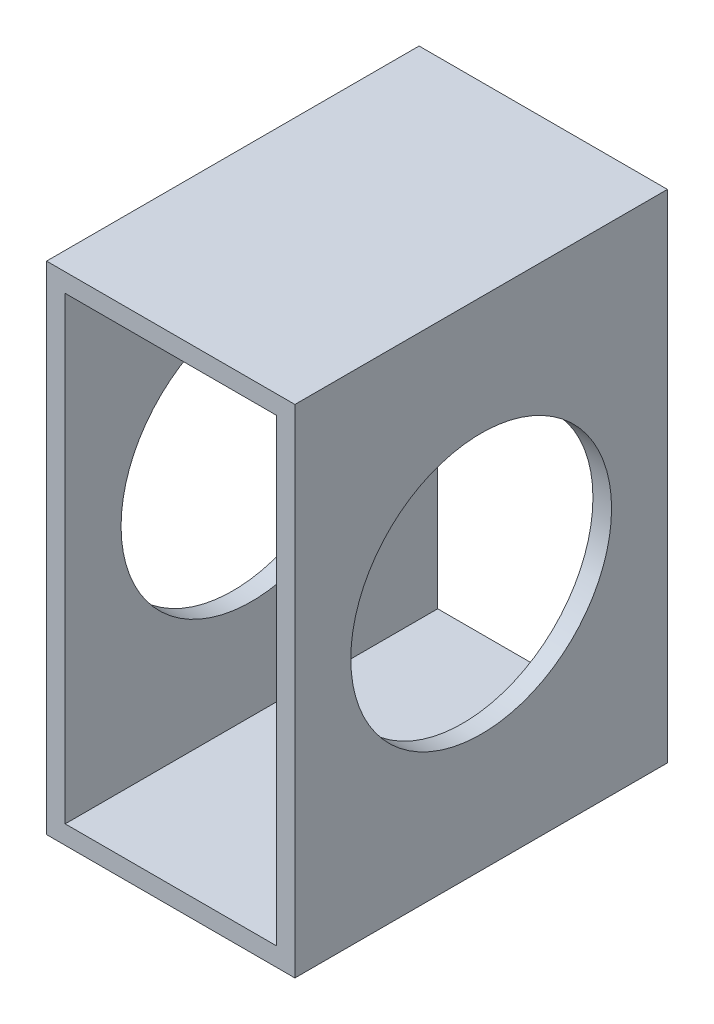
ISO-10303-21;
HEADER;
FILE_DESCRIPTION(('STEP AP214'),'2;1');
FILE_NAME('part.step','',(''),(''),'','','');
FILE_SCHEMA(('AUTOMOTIVE_DESIGN { 1 0 10303 214 1 1 1 1 }'));
ENDSEC;
DATA;
#1=APPLICATION_CONTEXT('core data for automotive mechanical design processes');
#2=APPLICATION_PROTOCOL_DEFINITION('international standard','automotive_design',2000,#1);
#3=PRODUCT_CONTEXT('',#1,'mechanical');
#4=PRODUCT('Part','Part','',(#3));
#5=PRODUCT_RELATED_PRODUCT_CATEGORY('part','',(#4));
#6=PRODUCT_DEFINITION_FORMATION('','',#4);
#7=PRODUCT_DEFINITION_CONTEXT('part definition',#1,'design');
#8=PRODUCT_DEFINITION('design','',#6,#7);
#9=PRODUCT_DEFINITION_SHAPE('','',#8);
#10=(LENGTH_UNIT() NAMED_UNIT(*) SI_UNIT(.MILLI.,.METRE.));
#11=(NAMED_UNIT(*) PLANE_ANGLE_UNIT() SI_UNIT($,.RADIAN.));
#12=(NAMED_UNIT(*) SI_UNIT($,.STERADIAN.) SOLID_ANGLE_UNIT());
#13=UNCERTAINTY_MEASURE_WITH_UNIT(LENGTH_MEASURE(1.E-05),#10,'distance_accuracy_value','');
#14=(GEOMETRIC_REPRESENTATION_CONTEXT(3) GLOBAL_UNCERTAINTY_ASSIGNED_CONTEXT((#13)) GLOBAL_UNIT_ASSIGNED_CONTEXT((#10,
#11,#12)) REPRESENTATION_CONTEXT('',''));
#15=CARTESIAN_POINT('',(0.,0.,0.));
#16=DIRECTION('',(0.,0.,1.));
#17=DIRECTION('',(1.,0.,0.));
#18=AXIS2_PLACEMENT_3D('',#15,#16,#17);
#19=CARTESIAN_POINT('',(0.,0.,30.));
#20=DIRECTION('',(0.,0.,1.));
#21=DIRECTION('',(1.,0.,0.));
#22=AXIS2_PLACEMENT_3D('',#19,#20,#21);
#23=PLANE('',#22);
#24=DIRECTION('',(0.,-1.,0.));
#25=VECTOR('',#24,1.);
#26=CARTESIAN_POINT('',(-20.,-40.,30.));
#27=LINE('',#26,#25);
#28=CARTESIAN_POINT('',(-20.,40.,30.));
#29=VERTEX_POINT('',#28);
#30=CARTESIAN_POINT('',(-20.,-40.,30.));
#31=VERTEX_POINT('',#30);
#32=EDGE_CURVE('E156',#29,#31,#27,.T.);
#33=ORIENTED_EDGE('',*,*,#32,.T.);
#34=DIRECTION('',(1.,0.,0.));
#35=VECTOR('',#34,1.);
#36=CARTESIAN_POINT('',(20.,-40.,30.));
#37=LINE('',#36,#35);
#38=CARTESIAN_POINT('',(20.,-40.,30.));
#39=VERTEX_POINT('',#38);
#40=EDGE_CURVE('E160',#31,#39,#37,.T.);
#41=ORIENTED_EDGE('',*,*,#40,.T.);
#42=DIRECTION('',(0.,1.,0.));
#43=VECTOR('',#42,1.);
#44=CARTESIAN_POINT('',(20.,-40.,30.));
#45=LINE('',#44,#43);
#46=CARTESIAN_POINT('',(20.,40.,30.));
#47=VERTEX_POINT('',#46);
#48=EDGE_CURVE('E164',#39,#47,#45,.T.);
#49=ORIENTED_EDGE('',*,*,#48,.T.);
#50=DIRECTION('',(-1.,0.,0.));
#51=VECTOR('',#50,1.);
#52=CARTESIAN_POINT('',(20.,40.,30.));
#53=LINE('',#52,#51);
#54=EDGE_CURVE('E167',#47,#29,#53,.T.);
#55=ORIENTED_EDGE('',*,*,#54,.T.);
#56=EDGE_LOOP('',(#33,#41,#49,#55));
#57=FACE_BOUND('',#56,.T.);
#58=DIRECTION('',(1.,0.,0.));
#59=VECTOR('',#58,1.);
#60=CARTESIAN_POINT('',(17.,-37.,30.));
#61=LINE('',#60,#59);
#62=CARTESIAN_POINT('',(-17.,-37.,30.));
#63=VERTEX_POINT('',#62);
#64=CARTESIAN_POINT('',(17.,-37.,30.));
#65=VERTEX_POINT('',#64);
#66=EDGE_CURVE('E115',#63,#65,#61,.T.);
#67=ORIENTED_EDGE('',*,*,#66,.F.);
#68=DIRECTION('',(0.,-1.,0.));
#69=VECTOR('',#68,1.);
#70=CARTESIAN_POINT('',(-17.,-37.,30.));
#71=LINE('',#70,#69);
#72=CARTESIAN_POINT('',(-17.,37.,30.));
#73=VERTEX_POINT('',#72);
#74=EDGE_CURVE('E106',#73,#63,#71,.T.);
#75=ORIENTED_EDGE('',*,*,#74,.F.);
#76=DIRECTION('',(-1.,0.,0.));
#77=VECTOR('',#76,1.);
#78=CARTESIAN_POINT('',(17.,37.,30.));
#79=LINE('',#78,#77);
#80=CARTESIAN_POINT('',(17.,37.,30.));
#81=VERTEX_POINT('',#80);
#82=EDGE_CURVE('E132',#81,#73,#79,.T.);
#83=ORIENTED_EDGE('',*,*,#82,.F.);
#84=DIRECTION('',(0.,1.,0.));
#85=VECTOR('',#84,1.);
#86=CARTESIAN_POINT('',(17.,-37.,30.));
#87=LINE('',#86,#85);
#88=EDGE_CURVE('E128',#65,#81,#87,.T.);
#89=ORIENTED_EDGE('',*,*,#88,.F.);
#90=EDGE_LOOP('',(#67,#75,#83,#89));
#91=FACE_BOUND('',#90,.T.);
#92=ADVANCED_FACE('F39',(#57,#91),#23,.T.);
#93=CARTESIAN_POINT('',(0.,0.,-30.));
#94=DIRECTION('',(0.,0.,1.));
#95=DIRECTION('',(1.,0.,0.));
#96=AXIS2_PLACEMENT_3D('',#93,#94,#95);
#97=PLANE('',#96);
#98=DIRECTION('',(0.,-1.,0.));
#99=VECTOR('',#98,1.);
#100=CARTESIAN_POINT('',(-20.,-40.,-30.));
#101=LINE('',#100,#99);
#102=CARTESIAN_POINT('',(-20.,40.,-30.));
#103=VERTEX_POINT('',#102);
#104=CARTESIAN_POINT('',(-20.,-40.,-30.));
#105=VERTEX_POINT('',#104);
#106=EDGE_CURVE('E124',#103,#105,#101,.T.);
#107=ORIENTED_EDGE('',*,*,#106,.F.);
#108=DIRECTION('',(-1.,0.,0.));
#109=VECTOR('',#108,1.);
#110=CARTESIAN_POINT('',(20.,40.,-30.));
#111=LINE('',#110,#109);
#112=CARTESIAN_POINT('',(20.,40.,-30.));
#113=VERTEX_POINT('',#112);
#114=EDGE_CURVE('E161',#113,#103,#111,.T.);
#115=ORIENTED_EDGE('',*,*,#114,.F.);
#116=DIRECTION('',(0.,1.,0.));
#117=VECTOR('',#116,1.);
#118=CARTESIAN_POINT('',(20.,-40.,-30.));
#119=LINE('',#118,#117);
#120=CARTESIAN_POINT('',(20.,-40.,-30.));
#121=VERTEX_POINT('',#120);
#122=EDGE_CURVE('E177',#121,#113,#119,.T.);
#123=ORIENTED_EDGE('',*,*,#122,.F.);
#124=DIRECTION('',(1.,0.,0.));
#125=VECTOR('',#124,1.);
#126=CARTESIAN_POINT('',(20.,-40.,-30.));
#127=LINE('',#126,#125);
#128=EDGE_CURVE('E174',#105,#121,#127,.T.);
#129=ORIENTED_EDGE('',*,*,#128,.F.);
#130=EDGE_LOOP('',(#107,#115,#123,#129));
#131=FACE_BOUND('',#130,.T.);
#132=DIRECTION('',(0.,-1.,0.));
#133=VECTOR('',#132,1.);
#134=CARTESIAN_POINT('',(-17.,-37.,-30.));
#135=LINE('',#134,#133);
#136=CARTESIAN_POINT('',(-17.,37.,-30.));
#137=VERTEX_POINT('',#136);
#138=CARTESIAN_POINT('',(-17.,-37.,-30.));
#139=VERTEX_POINT('',#138);
#140=EDGE_CURVE('E64',#137,#139,#135,.T.);
#141=ORIENTED_EDGE('',*,*,#140,.T.);
#142=DIRECTION('',(1.,0.,0.));
#143=VECTOR('',#142,1.);
#144=CARTESIAN_POINT('',(17.,-37.,-30.));
#145=LINE('',#144,#143);
#146=CARTESIAN_POINT('',(17.,-37.,-30.));
#147=VERTEX_POINT('',#146);
#148=EDGE_CURVE('E122',#139,#147,#145,.T.);
#149=ORIENTED_EDGE('',*,*,#148,.T.);
#150=DIRECTION('',(0.,1.,0.));
#151=VECTOR('',#150,1.);
#152=CARTESIAN_POINT('',(17.,-37.,-30.));
#153=LINE('',#152,#151);
#154=CARTESIAN_POINT('',(17.,37.,-30.));
#155=VERTEX_POINT('',#154);
#156=EDGE_CURVE('E143',#147,#155,#153,.T.);
#157=ORIENTED_EDGE('',*,*,#156,.T.);
#158=DIRECTION('',(-1.,0.,0.));
#159=VECTOR('',#158,1.);
#160=CARTESIAN_POINT('',(17.,37.,-30.));
#161=LINE('',#160,#159);
#162=EDGE_CURVE('E116',#155,#137,#161,.T.);
#163=ORIENTED_EDGE('',*,*,#162,.T.);
#164=EDGE_LOOP('',(#141,#149,#157,#163));
#165=FACE_BOUND('',#164,.T.);
#166=ADVANCED_FACE('F201',(#131,#165),#97,.F.);
#167=CARTESIAN_POINT('',(-20.,-40.,30.));
#168=DIRECTION('',(1.,0.,0.));
#169=DIRECTION('',(0.,0.,-1.));
#170=AXIS2_PLACEMENT_3D('',#167,#168,#169);
#171=PLANE('',#170);
#172=CARTESIAN_POINT('',(-20.,0.,0.));
#173=DIRECTION('',(1.,0.,0.));
#174=DIRECTION('',(0.,0.,-1.));
#175=AXIS2_PLACEMENT_3D('',#172,#173,#174);
#176=CIRCLE('',#175,21.);
#177=CARTESIAN_POINT('',(-20.,0.,-21.));
#178=VERTEX_POINT('',#177);
#179=EDGE_CURVE('E244',#178,#178,#176,.F.);
#180=ORIENTED_EDGE('',*,*,#179,.F.);
#181=EDGE_LOOP('',(#180));
#182=FACE_BOUND('',#181,.T.);
#183=ORIENTED_EDGE('',*,*,#106,.T.);
#184=DIRECTION('',(0.,0.,-1.));
#185=VECTOR('',#184,1.);
#186=CARTESIAN_POINT('',(-20.,-40.,30.));
#187=LINE('',#186,#185);
#188=EDGE_CURVE('E11',#31,#105,#187,.T.);
#189=ORIENTED_EDGE('',*,*,#188,.F.);
#190=ORIENTED_EDGE('',*,*,#32,.F.);
#191=DIRECTION('',(0.,0.,-1.));
#192=VECTOR('',#191,1.);
#193=CARTESIAN_POINT('',(-20.,40.,30.));
#194=LINE('',#193,#192);
#195=EDGE_CURVE('E170',#29,#103,#194,.T.);
#196=ORIENTED_EDGE('',*,*,#195,.T.);
#197=EDGE_LOOP('',(#183,#189,#190,#196));
#198=FACE_BOUND('',#197,.T.);
#199=ADVANCED_FACE('F41',(#182,#198),#171,.F.);
#200=CARTESIAN_POINT('',(20.,-40.,30.));
#201=DIRECTION('',(0.,1.,0.));
#202=DIRECTION('',(-1.,0.,0.));
#203=AXIS2_PLACEMENT_3D('',#200,#201,#202);
#204=PLANE('',#203);
#205=ORIENTED_EDGE('',*,*,#128,.T.);
#206=DIRECTION('',(0.,0.,-1.));
#207=VECTOR('',#206,1.);
#208=CARTESIAN_POINT('',(20.,-40.,30.));
#209=LINE('',#208,#207);
#210=EDGE_CURVE('E49',#39,#121,#209,.T.);
#211=ORIENTED_EDGE('',*,*,#210,.F.);
#212=ORIENTED_EDGE('',*,*,#40,.F.);
#213=ORIENTED_EDGE('',*,*,#188,.T.);
#214=EDGE_LOOP('',(#205,#211,#212,#213));
#215=FACE_BOUND('',#214,.T.);
#216=ADVANCED_FACE('F211',(#215),#204,.F.);
#217=CARTESIAN_POINT('',(20.,-40.,30.));
#218=DIRECTION('',(-1.,0.,0.));
#219=DIRECTION('',(0.,0.,1.));
#220=AXIS2_PLACEMENT_3D('',#217,#218,#219);
#221=PLANE('',#220);
#222=CARTESIAN_POINT('',(20.,0.,0.));
#223=DIRECTION('',(1.,0.,0.));
#224=DIRECTION('',(0.,0.,-1.));
#225=AXIS2_PLACEMENT_3D('',#222,#223,#224);
#226=CIRCLE('',#225,21.);
#227=CARTESIAN_POINT('',(20.,0.,-21.));
#228=VERTEX_POINT('',#227);
#229=EDGE_CURVE('E249',#228,#228,#226,.T.);
#230=ORIENTED_EDGE('',*,*,#229,.F.);
#231=EDGE_LOOP('',(#230));
#232=FACE_BOUND('',#231,.T.);
#233=ORIENTED_EDGE('',*,*,#122,.T.);
#234=DIRECTION('',(0.,0.,-1.));
#235=VECTOR('',#234,1.);
#236=CARTESIAN_POINT('',(20.,40.,30.));
#237=LINE('',#236,#235);
#238=EDGE_CURVE('E185',#47,#113,#237,.T.);
#239=ORIENTED_EDGE('',*,*,#238,.F.);
#240=ORIENTED_EDGE('',*,*,#48,.F.);
#241=ORIENTED_EDGE('',*,*,#210,.T.);
#242=EDGE_LOOP('',(#233,#239,#240,#241));
#243=FACE_BOUND('',#242,.T.);
#244=ADVANCED_FACE('F195',(#232,#243),#221,.F.);
#245=CARTESIAN_POINT('',(20.,40.,30.));
#246=DIRECTION('',(0.,-1.,0.));
#247=DIRECTION('',(1.,0.,0.));
#248=AXIS2_PLACEMENT_3D('',#245,#246,#247);
#249=PLANE('',#248);
#250=ORIENTED_EDGE('',*,*,#114,.T.);
#251=ORIENTED_EDGE('',*,*,#195,.F.);
#252=ORIENTED_EDGE('',*,*,#54,.F.);
#253=ORIENTED_EDGE('',*,*,#238,.T.);
#254=EDGE_LOOP('',(#250,#251,#252,#253));
#255=FACE_BOUND('',#254,.T.);
#256=ADVANCED_FACE('F205',(#255),#249,.F.);
#257=CARTESIAN_POINT('',(-17.,-37.,30.));
#258=DIRECTION('',(1.,0.,0.));
#259=DIRECTION('',(0.,0.,-1.));
#260=AXIS2_PLACEMENT_3D('',#257,#258,#259);
#261=PLANE('',#260);
#262=CARTESIAN_POINT('',(-17.,0.,0.));
#263=DIRECTION('',(1.,0.,0.));
#264=DIRECTION('',(0.,0.,-1.));
#265=AXIS2_PLACEMENT_3D('',#262,#263,#264);
#266=CIRCLE('',#265,21.);
#267=CARTESIAN_POINT('',(-17.,0.,-21.));
#268=VERTEX_POINT('',#267);
#269=EDGE_CURVE('E140',#268,#268,#266,.T.);
#270=ORIENTED_EDGE('',*,*,#269,.F.);
#271=EDGE_LOOP('',(#270));
#272=FACE_BOUND('',#271,.T.);
#273=ORIENTED_EDGE('',*,*,#140,.F.);
#274=DIRECTION('',(0.,0.,-1.));
#275=VECTOR('',#274,1.);
#276=CARTESIAN_POINT('',(-17.,37.,30.));
#277=LINE('',#276,#275);
#278=EDGE_CURVE('E110',#73,#137,#277,.T.);
#279=ORIENTED_EDGE('',*,*,#278,.F.);
#280=ORIENTED_EDGE('',*,*,#74,.T.);
#281=DIRECTION('',(0.,0.,-1.));
#282=VECTOR('',#281,1.);
#283=CARTESIAN_POINT('',(-17.,-37.,30.));
#284=LINE('',#283,#282);
#285=EDGE_CURVE('E109',#63,#139,#284,.T.);
#286=ORIENTED_EDGE('',*,*,#285,.T.);
#287=EDGE_LOOP('',(#273,#279,#280,#286));
#288=FACE_BOUND('',#287,.T.);
#289=ADVANCED_FACE('F108',(#272,#288),#261,.T.);
#290=CARTESIAN_POINT('',(17.,-37.,30.));
#291=DIRECTION('',(0.,1.,0.));
#292=DIRECTION('',(0.,0.,1.));
#293=AXIS2_PLACEMENT_3D('',#290,#291,#292);
#294=PLANE('',#293);
#295=ORIENTED_EDGE('',*,*,#148,.F.);
#296=ORIENTED_EDGE('',*,*,#285,.F.);
#297=ORIENTED_EDGE('',*,*,#66,.T.);
#298=DIRECTION('',(0.,0.,-1.));
#299=VECTOR('',#298,1.);
#300=CARTESIAN_POINT('',(17.,-37.,30.));
#301=LINE('',#300,#299);
#302=EDGE_CURVE('E125',#65,#147,#301,.T.);
#303=ORIENTED_EDGE('',*,*,#302,.T.);
#304=EDGE_LOOP('',(#295,#296,#297,#303));
#305=FACE_BOUND('',#304,.T.);
#306=ADVANCED_FACE('F119',(#305),#294,.T.);
#307=CARTESIAN_POINT('',(17.,-37.,30.));
#308=DIRECTION('',(-1.,0.,0.));
#309=DIRECTION('',(0.,0.,1.));
#310=AXIS2_PLACEMENT_3D('',#307,#308,#309);
#311=PLANE('',#310);
#312=CARTESIAN_POINT('',(17.,0.,0.));
#313=DIRECTION('',(-1.,0.,0.));
#314=DIRECTION('',(0.,0.,1.));
#315=AXIS2_PLACEMENT_3D('',#312,#313,#314);
#316=CIRCLE('',#315,21.);
#317=CARTESIAN_POINT('',(17.,0.,-21.));
#318=VERTEX_POINT('',#317);
#319=EDGE_CURVE('E43',#318,#318,#316,.T.);
#320=ORIENTED_EDGE('',*,*,#319,.F.);
#321=EDGE_LOOP('',(#320));
#322=FACE_BOUND('',#321,.T.);
#323=ORIENTED_EDGE('',*,*,#156,.F.);
#324=ORIENTED_EDGE('',*,*,#302,.F.);
#325=ORIENTED_EDGE('',*,*,#88,.T.);
#326=DIRECTION('',(0.,0.,-1.));
#327=VECTOR('',#326,1.);
#328=CARTESIAN_POINT('',(17.,37.,30.));
#329=LINE('',#328,#327);
#330=EDGE_CURVE('E56',#81,#155,#329,.T.);
#331=ORIENTED_EDGE('',*,*,#330,.T.);
#332=EDGE_LOOP('',(#323,#324,#325,#331));
#333=FACE_BOUND('',#332,.T.);
#334=ADVANCED_FACE('F237',(#322,#333),#311,.T.);
#335=CARTESIAN_POINT('',(17.,37.,30.));
#336=DIRECTION('',(0.,-1.,0.));
#337=DIRECTION('',(0.,0.,-1.));
#338=AXIS2_PLACEMENT_3D('',#335,#336,#337);
#339=PLANE('',#338);
#340=ORIENTED_EDGE('',*,*,#162,.F.);
#341=ORIENTED_EDGE('',*,*,#330,.F.);
#342=ORIENTED_EDGE('',*,*,#82,.T.);
#343=ORIENTED_EDGE('',*,*,#278,.T.);
#344=EDGE_LOOP('',(#340,#341,#342,#343));
#345=FACE_BOUND('',#344,.T.);
#346=ADVANCED_FACE('F257',(#345),#339,.T.);
#347=CARTESIAN_POINT('',(-79.39696961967,0.,0.));
#348=DIRECTION('',(1.,0.,0.));
#349=DIRECTION('',(0.,0.,-1.));
#350=AXIS2_PLACEMENT_3D('',#347,#348,#349);
#351=CYLINDRICAL_SURFACE('',#350,21.);
#352=CARTESIAN_POINT('',(17.,0.,-21.));
#353=CARTESIAN_POINT('',(17.03125,0.,-21.));
#354=CARTESIAN_POINT('',(17.0625,0.,-21.));
#355=CARTESIAN_POINT('',(17.125,0.,-21.));
#356=CARTESIAN_POINT('',(17.15625,0.,-21.));
#357=CARTESIAN_POINT('',(17.21875,0.,-21.));
#358=CARTESIAN_POINT('',(17.25,0.,-21.));
#359=CARTESIAN_POINT('',(17.3125,0.,-21.));
#360=CARTESIAN_POINT('',(17.34375,0.,-21.));
#361=CARTESIAN_POINT('',(17.40625,0.,-21.));
#362=CARTESIAN_POINT('',(17.4375,0.,-21.));
#363=CARTESIAN_POINT('',(17.5,0.,-21.));
#364=CARTESIAN_POINT('',(17.53125,0.,-21.));
#365=CARTESIAN_POINT('',(17.59375,0.,-21.));
#366=CARTESIAN_POINT('',(17.625,0.,-21.));
#367=CARTESIAN_POINT('',(17.6875,0.,-21.));
#368=CARTESIAN_POINT('',(17.71875,0.,-21.));
#369=CARTESIAN_POINT('',(17.78125,0.,-21.));
#370=CARTESIAN_POINT('',(17.8125,0.,-21.));
#371=CARTESIAN_POINT('',(17.875,0.,-21.));
#372=CARTESIAN_POINT('',(17.90625,0.,-21.));
#373=CARTESIAN_POINT('',(17.96875,0.,-21.));
#374=CARTESIAN_POINT('',(18.,0.,-21.));
#375=CARTESIAN_POINT('',(18.0625,0.,-21.));
#376=CARTESIAN_POINT('',(18.09375,0.,-21.));
#377=CARTESIAN_POINT('',(18.15625,0.,-21.));
#378=CARTESIAN_POINT('',(18.1875,0.,-21.));
#379=CARTESIAN_POINT('',(18.25,0.,-21.));
#380=CARTESIAN_POINT('',(18.28125,0.,-21.));
#381=CARTESIAN_POINT('',(18.34375,0.,-21.));
#382=CARTESIAN_POINT('',(18.375,0.,-21.));
#383=CARTESIAN_POINT('',(18.4375,0.,-21.));
#384=CARTESIAN_POINT('',(18.46875,0.,-21.));
#385=CARTESIAN_POINT('',(18.53125,0.,-21.));
#386=CARTESIAN_POINT('',(18.5625,0.,-21.));
#387=CARTESIAN_POINT('',(18.625,0.,-21.));
#388=CARTESIAN_POINT('',(18.65625,0.,-21.));
#389=CARTESIAN_POINT('',(18.71875,0.,-21.));
#390=CARTESIAN_POINT('',(18.75,0.,-21.));
#391=CARTESIAN_POINT('',(18.8125,0.,-21.));
#392=CARTESIAN_POINT('',(18.84375,0.,-21.));
#393=CARTESIAN_POINT('',(18.90625,0.,-21.));
#394=CARTESIAN_POINT('',(18.9375,0.,-21.));
#395=CARTESIAN_POINT('',(19.,0.,-21.));
#396=CARTESIAN_POINT('',(19.03125,0.,-21.));
#397=CARTESIAN_POINT('',(19.09375,0.,-21.));
#398=CARTESIAN_POINT('',(19.125,0.,-21.));
#399=CARTESIAN_POINT('',(19.1875,0.,-21.));
#400=CARTESIAN_POINT('',(19.21875,0.,-21.));
#401=CARTESIAN_POINT('',(19.28125,0.,-21.));
#402=CARTESIAN_POINT('',(19.3125,0.,-21.));
#403=CARTESIAN_POINT('',(19.375,0.,-21.));
#404=CARTESIAN_POINT('',(19.40625,0.,-21.));
#405=CARTESIAN_POINT('',(19.46875,0.,-21.));
#406=CARTESIAN_POINT('',(19.5,0.,-21.));
#407=CARTESIAN_POINT('',(19.5625,0.,-21.));
#408=CARTESIAN_POINT('',(19.59375,0.,-21.));
#409=CARTESIAN_POINT('',(19.65625,0.,-21.));
#410=CARTESIAN_POINT('',(19.6875,0.,-21.));
#411=CARTESIAN_POINT('',(19.75,0.,-21.));
#412=CARTESIAN_POINT('',(19.78125,0.,-21.));
#413=CARTESIAN_POINT('',(19.84375,0.,-21.));
#414=CARTESIAN_POINT('',(19.875,0.,-21.));
#415=CARTESIAN_POINT('',(19.9375,0.,-21.));
#416=CARTESIAN_POINT('',(19.96875,0.,-21.));
#417=CARTESIAN_POINT('',(20.,0.,-21.));
#418=B_SPLINE_CURVE_WITH_KNOTS('',3,(#352,#353,#354,#355,#356,#357,#358,#359,#360,#361,#362,
#363,#364,#365,#366,#367,#368,#369,#370,#371,#372,#373,#374,#375,#376,#377,#378,#379,#380,#381,
#382,#383,#384,#385,#386,#387,#388,#389,#390,#391,#392,#393,#394,#395,#396,#397,#398,#399,#400,
#401,#402,#403,#404,#405,#406,#407,#408,#409,#410,#411,#412,#413,#414,#415,#416,#417),
.UNSPECIFIED.,.F.,.F.,(4,2,2,2,2,2,2,2,2,2,2,2,2,2,2,2,2,2,2,2,2,2,2,2,2,2,2,2,2,2,2,2,4),(0.,
0.0937500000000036,0.187499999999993,0.281249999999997,0.375,0.46874999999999,0.562499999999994,
0.656249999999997,0.750000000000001,0.84374999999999,0.937499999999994,1.03125,1.12499999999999,
1.21874999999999,1.31249999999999,1.40624999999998,1.49999999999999,1.59374999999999,
1.68749999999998,1.78124999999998,1.87499999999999,1.96874999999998,2.06249999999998,
2.15624999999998,2.24999999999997,2.34374999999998,2.43749999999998,2.53124999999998,
2.62499999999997,2.71874999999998,2.81249999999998,2.90624999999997,2.99999999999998),.UNSPECIFIED.);
#419=EDGE_CURVE('BSEAM254',#318,#228,#418,.T.);
#420=ORIENTED_EDGE('',*,*,#319,.T.);
#421=ORIENTED_EDGE('',*,*,#229,.T.);
#422=ORIENTED_EDGE('',*,*,#419,.T.);
#423=ORIENTED_EDGE('',*,*,#419,.F.);
#424=EDGE_LOOP('',(#420,#422,#421,#423));
#425=FACE_BOUND('',#424,.T.);
#426=ADVANCED_FACE('F254',(#425),#351,.F.);
#427=CARTESIAN_POINT('',(-17.,0.,-21.));
#428=CARTESIAN_POINT('',(-17.03125,0.,-21.));
#429=CARTESIAN_POINT('',(-17.0625,0.,-21.));
#430=CARTESIAN_POINT('',(-17.125,0.,-21.));
#431=CARTESIAN_POINT('',(-17.15625,0.,-21.));
#432=CARTESIAN_POINT('',(-17.21875,0.,-21.));
#433=CARTESIAN_POINT('',(-17.25,0.,-21.));
#434=CARTESIAN_POINT('',(-17.3125,0.,-21.));
#435=CARTESIAN_POINT('',(-17.34375,0.,-21.));
#436=CARTESIAN_POINT('',(-17.40625,0.,-21.));
#437=CARTESIAN_POINT('',(-17.4375,0.,-21.));
#438=CARTESIAN_POINT('',(-17.5,0.,-21.));
#439=CARTESIAN_POINT('',(-17.53125,0.,-21.));
#440=CARTESIAN_POINT('',(-17.59375,0.,-21.));
#441=CARTESIAN_POINT('',(-17.625,0.,-21.));
#442=CARTESIAN_POINT('',(-17.6875,0.,-21.));
#443=CARTESIAN_POINT('',(-17.71875,0.,-21.));
#444=CARTESIAN_POINT('',(-17.78125,0.,-21.));
#445=CARTESIAN_POINT('',(-17.8125,0.,-21.));
#446=CARTESIAN_POINT('',(-17.875,0.,-21.));
#447=CARTESIAN_POINT('',(-17.90625,0.,-21.));
#448=CARTESIAN_POINT('',(-17.96875,0.,-21.));
#449=CARTESIAN_POINT('',(-18.,0.,-21.));
#450=CARTESIAN_POINT('',(-18.0625,0.,-21.));
#451=CARTESIAN_POINT('',(-18.09375,0.,-21.));
#452=CARTESIAN_POINT('',(-18.15625,0.,-21.));
#453=CARTESIAN_POINT('',(-18.1875,0.,-21.));
#454=CARTESIAN_POINT('',(-18.25,0.,-21.));
#455=CARTESIAN_POINT('',(-18.28125,0.,-21.));
#456=CARTESIAN_POINT('',(-18.34375,0.,-21.));
#457=CARTESIAN_POINT('',(-18.375,0.,-21.));
#458=CARTESIAN_POINT('',(-18.4375,0.,-21.));
#459=CARTESIAN_POINT('',(-18.46875,0.,-21.));
#460=CARTESIAN_POINT('',(-18.53125,0.,-21.));
#461=CARTESIAN_POINT('',(-18.5625,0.,-21.));
#462=CARTESIAN_POINT('',(-18.625,0.,-21.));
#463=CARTESIAN_POINT('',(-18.65625,0.,-21.));
#464=CARTESIAN_POINT('',(-18.71875,0.,-21.));
#465=CARTESIAN_POINT('',(-18.75,0.,-21.));
#466=CARTESIAN_POINT('',(-18.8125,0.,-21.));
#467=CARTESIAN_POINT('',(-18.84375,0.,-21.));
#468=CARTESIAN_POINT('',(-18.90625,0.,-21.));
#469=CARTESIAN_POINT('',(-18.9375,0.,-21.));
#470=CARTESIAN_POINT('',(-19.,0.,-21.));
#471=CARTESIAN_POINT('',(-19.03125,0.,-21.));
#472=CARTESIAN_POINT('',(-19.09375,0.,-21.));
#473=CARTESIAN_POINT('',(-19.125,0.,-21.));
#474=CARTESIAN_POINT('',(-19.1875,0.,-21.));
#475=CARTESIAN_POINT('',(-19.21875,0.,-21.));
#476=CARTESIAN_POINT('',(-19.28125,0.,-21.));
#477=CARTESIAN_POINT('',(-19.3125,0.,-21.));
#478=CARTESIAN_POINT('',(-19.375,0.,-21.));
#479=CARTESIAN_POINT('',(-19.40625,0.,-21.));
#480=CARTESIAN_POINT('',(-19.46875,0.,-21.));
#481=CARTESIAN_POINT('',(-19.5,0.,-21.));
#482=CARTESIAN_POINT('',(-19.5625,0.,-21.));
#483=CARTESIAN_POINT('',(-19.59375,0.,-21.));
#484=CARTESIAN_POINT('',(-19.65625,0.,-21.));
#485=CARTESIAN_POINT('',(-19.6875,0.,-21.));
#486=CARTESIAN_POINT('',(-19.75,0.,-21.));
#487=CARTESIAN_POINT('',(-19.78125,0.,-21.));
#488=CARTESIAN_POINT('',(-19.84375,0.,-21.));
#489=CARTESIAN_POINT('',(-19.875,0.,-21.));
#490=CARTESIAN_POINT('',(-19.9375,0.,-21.));
#491=CARTESIAN_POINT('',(-19.96875,0.,-21.));
#492=CARTESIAN_POINT('',(-20.,0.,-21.));
#493=B_SPLINE_CURVE_WITH_KNOTS('',3,(#427,#428,#429,#430,#431,#432,#433,#434,#435,#436,#437,
#438,#439,#440,#441,#442,#443,#444,#445,#446,#447,#448,#449,#450,#451,#452,#453,#454,#455,#456,
#457,#458,#459,#460,#461,#462,#463,#464,#465,#466,#467,#468,#469,#470,#471,#472,#473,#474,#475,
#476,#477,#478,#479,#480,#481,#482,#483,#484,#485,#486,#487,#488,#489,#490,#491,#492),
.UNSPECIFIED.,.F.,.F.,(4,2,2,2,2,2,2,2,2,2,2,2,2,2,2,2,2,2,2,2,2,2,2,2,2,2,2,2,2,2,2,2,4),(0.,
0.0937500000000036,0.1875,0.281250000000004,0.375,0.468750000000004,0.5625,0.656250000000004,
0.750000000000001,0.843750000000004,0.937500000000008,1.03125,1.12500000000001,1.21875,
1.31250000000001,1.40625,1.50000000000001,1.59375000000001,1.68750000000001,1.78125000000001,
1.87500000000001,1.96875000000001,2.06250000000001,2.15625000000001,2.25000000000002,
2.34375000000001,2.43750000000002,2.53125000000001,2.62500000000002,2.71875000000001,
2.81250000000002,2.90625000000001,3.00000000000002),.UNSPECIFIED.);
#494=EDGE_CURVE('BSEAM256',#268,#178,#493,.T.);
#495=ORIENTED_EDGE('',*,*,#269,.T.);
#496=ORIENTED_EDGE('',*,*,#179,.T.);
#497=ORIENTED_EDGE('',*,*,#494,.T.);
#498=ORIENTED_EDGE('',*,*,#494,.F.);
#499=EDGE_LOOP('',(#495,#497,#496,#498));
#500=FACE_BOUND('',#499,.T.);
#501=ADVANCED_FACE('F256',(#500),#351,.F.);
#502=CLOSED_SHELL('',(#92,#166,#199,#216,#244,#256,#289,#306,#334,#346,#426,#501));
#503=MANIFOLD_SOLID_BREP('B2',#502);
#504=ADVANCED_BREP_SHAPE_REPRESENTATION('',(#18,#503),#14);
#505=SHAPE_DEFINITION_REPRESENTATION(#9,#504);
ENDSEC;
END-ISO-10303-21;
